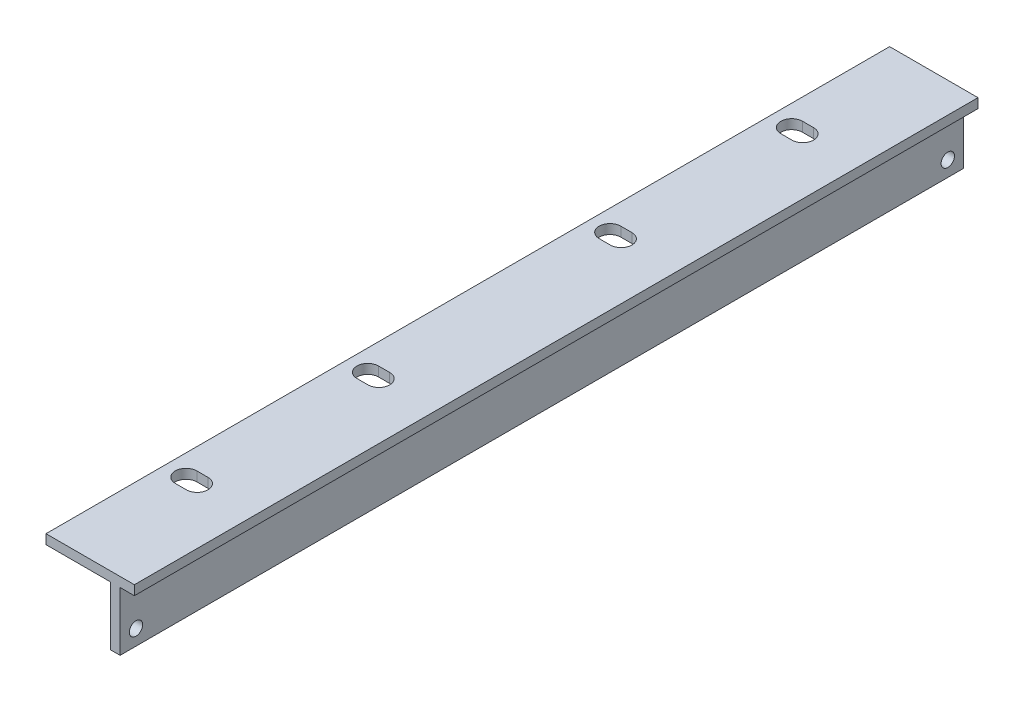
ISO-10303-21;
HEADER;
FILE_DESCRIPTION(('STEP AP214'),'2;1');
FILE_NAME('part.step','',(''),(''),'','','');
FILE_SCHEMA(('AUTOMOTIVE_DESIGN { 1 0 10303 214 1 1 1 1 }'));
ENDSEC;
DATA;
#1=APPLICATION_CONTEXT('core data for automotive mechanical design processes');
#2=APPLICATION_PROTOCOL_DEFINITION('international standard','automotive_design',2000,#1);
#3=PRODUCT_CONTEXT('',#1,'mechanical');
#4=PRODUCT('Part','Part','',(#3));
#5=PRODUCT_RELATED_PRODUCT_CATEGORY('part','',(#4));
#6=PRODUCT_DEFINITION_FORMATION('','',#4);
#7=PRODUCT_DEFINITION_CONTEXT('part definition',#1,'design');
#8=PRODUCT_DEFINITION('design','',#6,#7);
#9=PRODUCT_DEFINITION_SHAPE('','',#8);
#10=(LENGTH_UNIT() NAMED_UNIT(*) SI_UNIT(.MILLI.,.METRE.));
#11=(NAMED_UNIT(*) PLANE_ANGLE_UNIT() SI_UNIT($,.RADIAN.));
#12=(NAMED_UNIT(*) SI_UNIT($,.STERADIAN.) SOLID_ANGLE_UNIT());
#13=UNCERTAINTY_MEASURE_WITH_UNIT(LENGTH_MEASURE(1.E-05),#10,'distance_accuracy_value','');
#14=(GEOMETRIC_REPRESENTATION_CONTEXT(3) GLOBAL_UNCERTAINTY_ASSIGNED_CONTEXT((#13)) GLOBAL_UNIT_ASSIGNED_CONTEXT((#10,
#11,#12)) REPRESENTATION_CONTEXT('',''));
#15=CARTESIAN_POINT('',(0.,0.,0.));
#16=DIRECTION('',(0.,0.,1.));
#17=DIRECTION('',(1.,0.,0.));
#18=AXIS2_PLACEMENT_3D('',#15,#16,#17);
#19=CARTESIAN_POINT('',(-4.50000000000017,-2.99999999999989,-132.));
#20=DIRECTION('',(0.,-1.,0.));
#21=DIRECTION('',(0.,0.,-1.));
#22=AXIS2_PLACEMENT_3D('',#19,#20,#21);
#23=PLANE('',#22);
#24=DIRECTION('',(-1.,0.,0.));
#25=VECTOR('',#24,1.);
#26=CARTESIAN_POINT('',(-4.50000000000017,-2.99999999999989,0.));
#27=LINE('',#26,#25);
#28=CARTESIAN_POINT('',(0.,-2.99999999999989,0.));
#29=VERTEX_POINT('',#28);
#30=CARTESIAN_POINT('',(-4.50000000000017,-2.99999999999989,0.));
#31=VERTEX_POINT('',#30);
#32=EDGE_CURVE('E214',#29,#31,#27,.T.);
#33=ORIENTED_EDGE('',*,*,#32,.F.);
#34=DIRECTION('',(0.,0.,-1.));
#35=VECTOR('',#34,1.);
#36=CARTESIAN_POINT('',(0.,-2.99999999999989,-132.));
#37=LINE('',#36,#35);
#38=CARTESIAN_POINT('',(0.,-2.99999999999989,265.35));
#39=VERTEX_POINT('',#38);
#40=EDGE_CURVE('E43',#39,#29,#37,.T.);
#41=ORIENTED_EDGE('',*,*,#40,.F.);
#42=DIRECTION('',(1.,0.,0.));
#43=VECTOR('',#42,1.);
#44=CARTESIAN_POINT('',(-4.50000000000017,-2.99999999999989,265.35));
#45=LINE('',#44,#43);
#46=CARTESIAN_POINT('',(-4.50000000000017,-2.99999999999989,265.35));
#47=VERTEX_POINT('',#46);
#48=EDGE_CURVE('E243',#47,#39,#45,.T.);
#49=ORIENTED_EDGE('',*,*,#48,.F.);
#50=DIRECTION('',(0.,0.,-1.));
#51=VECTOR('',#50,1.);
#52=CARTESIAN_POINT('',(-4.50000000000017,-2.99999999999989,-132.));
#53=LINE('',#52,#51);
#54=EDGE_CURVE('E252',#31,#47,#53,.F.);
#55=ORIENTED_EDGE('',*,*,#54,.F.);
#56=EDGE_LOOP('',(#33,#41,#49,#55));
#57=FACE_BOUND('',#56,.T.);
#58=ADVANCED_FACE('F35',(#57),#23,.T.);
#59=CARTESIAN_POINT('',(-4.50000000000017,-2.99999999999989,-132.));
#60=DIRECTION('',(1.,0.,0.));
#61=DIRECTION('',(0.,0.,-1.));
#62=AXIS2_PLACEMENT_3D('',#59,#60,#61);
#63=PLANE('',#62);
#64=CARTESIAN_POINT('',(-4.50000000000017,-16.6699999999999,5.));
#65=DIRECTION('',(1.,0.,0.));
#66=DIRECTION('',(0.,0.,1.));
#67=AXIS2_PLACEMENT_3D('',#64,#65,#66);
#68=CIRCLE('',#67,2.09999999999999);
#69=CARTESIAN_POINT('',(-4.50000000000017,-16.6699999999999,7.09999999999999));
#70=VERTEX_POINT('',#69);
#71=EDGE_CURVE('E287',#70,#70,#68,.T.);
#72=ORIENTED_EDGE('',*,*,#71,.F.);
#73=EDGE_LOOP('',(#72));
#74=FACE_BOUND('',#73,.T.);
#75=CARTESIAN_POINT('',(-4.50000000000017,-16.6699999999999,260.35));
#76=DIRECTION('',(1.,0.,0.));
#77=DIRECTION('',(0.,0.,-1.));
#78=AXIS2_PLACEMENT_3D('',#75,#76,#77);
#79=CIRCLE('',#78,2.09999999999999);
#80=CARTESIAN_POINT('',(-4.50000000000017,-16.6699999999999,258.25));
#81=VERTEX_POINT('',#80);
#82=EDGE_CURVE('E276',#81,#81,#79,.T.);
#83=ORIENTED_EDGE('',*,*,#82,.F.);
#84=EDGE_LOOP('',(#83));
#85=FACE_BOUND('',#84,.T.);
#86=DIRECTION('',(0.,-1.,0.));
#87=VECTOR('',#86,1.);
#88=CARTESIAN_POINT('',(-4.50000000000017,-2.99999999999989,0.));
#89=LINE('',#88,#87);
#90=CARTESIAN_POINT('',(-4.50000000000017,-21.4999999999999,0.));
#91=VERTEX_POINT('',#90);
#92=EDGE_CURVE('E291',#31,#91,#89,.T.);
#93=ORIENTED_EDGE('',*,*,#92,.F.);
#94=ORIENTED_EDGE('',*,*,#54,.T.);
#95=DIRECTION('',(0.,1.,0.));
#96=VECTOR('',#95,1.);
#97=CARTESIAN_POINT('',(-4.50000000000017,-21.4999999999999,265.35));
#98=LINE('',#97,#96);
#99=CARTESIAN_POINT('',(-4.50000000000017,-21.4999999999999,265.35));
#100=VERTEX_POINT('',#99);
#101=EDGE_CURVE('E240',#100,#47,#98,.T.);
#102=ORIENTED_EDGE('',*,*,#101,.F.);
#103=DIRECTION('',(0.,0.,-1.));
#104=VECTOR('',#103,1.);
#105=CARTESIAN_POINT('',(-4.50000000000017,-21.4999999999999,-132.));
#106=LINE('',#105,#104);
#107=EDGE_CURVE('E270',#91,#100,#106,.F.);
#108=ORIENTED_EDGE('',*,*,#107,.F.);
#109=EDGE_LOOP('',(#93,#94,#102,#108));
#110=FACE_BOUND('',#109,.T.);
#111=ADVANCED_FACE('F455',(#74,#85,#110),#63,.T.);
#112=CARTESIAN_POINT('',(-7.50000000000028,-21.4999999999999,-132.));
#113=DIRECTION('',(0.,-1.,0.));
#114=DIRECTION('',(0.,0.,-1.));
#115=AXIS2_PLACEMENT_3D('',#112,#113,#114);
#116=PLANE('',#115);
#117=DIRECTION('',(-1.,0.,0.));
#118=VECTOR('',#117,1.);
#119=CARTESIAN_POINT('',(-7.50000000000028,-21.4999999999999,0.));
#120=LINE('',#119,#118);
#121=CARTESIAN_POINT('',(-7.50000000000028,-21.4999999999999,0.));
#122=VERTEX_POINT('',#121);
#123=EDGE_CURVE('E280',#91,#122,#120,.T.);
#124=ORIENTED_EDGE('',*,*,#123,.F.);
#125=ORIENTED_EDGE('',*,*,#107,.T.);
#126=DIRECTION('',(1.,0.,0.));
#127=VECTOR('',#126,1.);
#128=CARTESIAN_POINT('',(-7.50000000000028,-21.4999999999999,265.35));
#129=LINE('',#128,#127);
#130=CARTESIAN_POINT('',(-7.50000000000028,-21.4999999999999,265.35));
#131=VERTEX_POINT('',#130);
#132=EDGE_CURVE('E237',#131,#100,#129,.T.);
#133=ORIENTED_EDGE('',*,*,#132,.F.);
#134=DIRECTION('',(0.,0.,1.));
#135=VECTOR('',#134,1.);
#136=CARTESIAN_POINT('',(-7.50000000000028,-21.4999999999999,-132.));
#137=LINE('',#136,#135);
#138=EDGE_CURVE('E267',#122,#131,#137,.T.);
#139=ORIENTED_EDGE('',*,*,#138,.F.);
#140=EDGE_LOOP('',(#124,#125,#133,#139));
#141=FACE_BOUND('',#140,.T.);
#142=ADVANCED_FACE('F452',(#141),#116,.T.);
#143=CARTESIAN_POINT('',(-7.50000000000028,-2.99999999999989,-132.));
#144=DIRECTION('',(-1.,0.,0.));
#145=DIRECTION('',(0.,0.,1.));
#146=AXIS2_PLACEMENT_3D('',#143,#144,#145);
#147=PLANE('',#146);
#148=CARTESIAN_POINT('',(-7.50000000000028,-16.6699999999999,5.));
#149=DIRECTION('',(-1.,0.,0.));
#150=DIRECTION('',(0.,0.,1.));
#151=AXIS2_PLACEMENT_3D('',#148,#149,#150);
#152=CIRCLE('',#151,2.09999999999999);
#153=CARTESIAN_POINT('',(-7.50000000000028,-16.6699999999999,7.09999999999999));
#154=VERTEX_POINT('',#153);
#155=EDGE_CURVE('E38',#154,#154,#152,.T.);
#156=ORIENTED_EDGE('',*,*,#155,.F.);
#157=EDGE_LOOP('',(#156));
#158=FACE_BOUND('',#157,.T.);
#159=CARTESIAN_POINT('',(-7.50000000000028,-16.6699999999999,260.35));
#160=DIRECTION('',(-1.,0.,0.));
#161=DIRECTION('',(0.,0.,1.));
#162=AXIS2_PLACEMENT_3D('',#159,#160,#161);
#163=CIRCLE('',#162,2.09999999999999);
#164=CARTESIAN_POINT('',(-7.50000000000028,-16.6699999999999,262.45));
#165=VERTEX_POINT('',#164);
#166=EDGE_CURVE('E273',#165,#165,#163,.T.);
#167=ORIENTED_EDGE('',*,*,#166,.F.);
#168=EDGE_LOOP('',(#167));
#169=FACE_BOUND('',#168,.T.);
#170=DIRECTION('',(0.,1.,0.));
#171=VECTOR('',#170,1.);
#172=CARTESIAN_POINT('',(-7.50000000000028,-2.99999999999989,0.));
#173=LINE('',#172,#171);
#174=CARTESIAN_POINT('',(-7.50000000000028,-2.99999999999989,0.));
#175=VERTEX_POINT('',#174);
#176=EDGE_CURVE('E275',#122,#175,#173,.T.);
#177=ORIENTED_EDGE('',*,*,#176,.F.);
#178=ORIENTED_EDGE('',*,*,#138,.T.);
#179=DIRECTION('',(0.,-1.,0.));
#180=VECTOR('',#179,1.);
#181=CARTESIAN_POINT('',(-7.50000000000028,-2.99999999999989,265.35));
#182=LINE('',#181,#180);
#183=CARTESIAN_POINT('',(-7.50000000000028,-2.99999999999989,265.35));
#184=VERTEX_POINT('',#183);
#185=EDGE_CURVE('E234',#184,#131,#182,.T.);
#186=ORIENTED_EDGE('',*,*,#185,.F.);
#187=DIRECTION('',(0.,0.,-1.));
#188=VECTOR('',#187,1.);
#189=CARTESIAN_POINT('',(-7.50000000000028,-2.99999999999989,-132.));
#190=LINE('',#189,#188);
#191=EDGE_CURVE('E257',#175,#184,#190,.F.);
#192=ORIENTED_EDGE('',*,*,#191,.F.);
#193=EDGE_LOOP('',(#177,#178,#186,#192));
#194=FACE_BOUND('',#193,.T.);
#195=ADVANCED_FACE('F448',(#158,#169,#194),#147,.T.);
#196=CARTESIAN_POINT('',(-27.8,-2.99999999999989,-132.));
#197=DIRECTION('',(0.,-1.,0.));
#198=DIRECTION('',(0.,0.,-1.));
#199=AXIS2_PLACEMENT_3D('',#196,#197,#198);
#200=PLANE('',#199);
#201=DIRECTION('',(1.,0.,0.));
#202=VECTOR('',#201,1.);
#203=CARTESIAN_POINT('',(-24.8,-2.99999999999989,0.));
#204=LINE('',#203,#202);
#205=CARTESIAN_POINT('',(-27.8,-2.99999999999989,0.));
#206=VERTEX_POINT('',#205);
#207=EDGE_CURVE('E224',#206,#175,#204,.T.);
#208=ORIENTED_EDGE('',*,*,#207,.T.);
#209=ORIENTED_EDGE('',*,*,#191,.T.);
#210=DIRECTION('',(1.,0.,0.));
#211=VECTOR('',#210,1.);
#212=CARTESIAN_POINT('',(-27.8,-2.99999999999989,265.35));
#213=LINE('',#212,#211);
#214=CARTESIAN_POINT('',(-27.8,-2.99999999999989,265.35));
#215=VERTEX_POINT('',#214);
#216=EDGE_CURVE('E226',#215,#184,#213,.T.);
#217=ORIENTED_EDGE('',*,*,#216,.F.);
#218=DIRECTION('',(0.,0.,-1.));
#219=VECTOR('',#218,1.);
#220=CARTESIAN_POINT('',(-27.8,-2.99999999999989,265.35));
#221=LINE('',#220,#219);
#222=EDGE_CURVE('E247',#215,#206,#221,.T.);
#223=ORIENTED_EDGE('',*,*,#222,.T.);
#224=EDGE_LOOP('',(#208,#209,#217,#223));
#225=FACE_BOUND('',#224,.T.);
#226=CARTESIAN_POINT('',(-21.1799999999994,-2.99999999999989,227.925));
#227=DIRECTION('',(0.,-1.,0.));
#228=DIRECTION('',(0.,0.,-1.));
#229=AXIS2_PLACEMENT_3D('',#226,#227,#228);
#230=CIRCLE('',#229,3.39999999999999);
#231=CARTESIAN_POINT('',(-21.1799999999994,-2.99999999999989,231.325));
#232=VERTEX_POINT('',#231);
#233=CARTESIAN_POINT('',(-21.1799999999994,-2.99999999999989,224.525));
#234=VERTEX_POINT('',#233);
#235=EDGE_CURVE('E316',#232,#234,#230,.T.);
#236=ORIENTED_EDGE('',*,*,#235,.F.);
#237=DIRECTION('',(-1.,0.,0.));
#238=VECTOR('',#237,1.);
#239=CARTESIAN_POINT('',(-27.8,-2.99999999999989,231.325));
#240=LINE('',#239,#238);
#241=CARTESIAN_POINT('',(-17.6799999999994,-2.99999999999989,231.325));
#242=VERTEX_POINT('',#241);
#243=EDGE_CURVE('E306',#242,#232,#240,.T.);
#244=ORIENTED_EDGE('',*,*,#243,.F.);
#245=CARTESIAN_POINT('',(-17.6799999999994,-2.99999999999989,227.925));
#246=DIRECTION('',(0.,-1.,0.));
#247=DIRECTION('',(0.,0.,-1.));
#248=AXIS2_PLACEMENT_3D('',#245,#246,#247);
#249=CIRCLE('',#248,3.39999999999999);
#250=CARTESIAN_POINT('',(-17.6799999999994,-2.99999999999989,224.525));
#251=VERTEX_POINT('',#250);
#252=EDGE_CURVE('E312',#251,#242,#249,.T.);
#253=ORIENTED_EDGE('',*,*,#252,.F.);
#254=DIRECTION('',(1.,0.,0.));
#255=VECTOR('',#254,1.);
#256=CARTESIAN_POINT('',(-27.8,-2.99999999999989,224.525));
#257=LINE('',#256,#255);
#258=EDGE_CURVE('E314',#234,#251,#257,.T.);
#259=ORIENTED_EDGE('',*,*,#258,.F.);
#260=EDGE_LOOP('',(#236,#244,#253,#259));
#261=FACE_BOUND('',#260,.T.);
#262=CARTESIAN_POINT('',(-21.1800000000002,-2.99999999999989,37.425));
#263=DIRECTION('',(0.,-1.,0.));
#264=DIRECTION('',(0.,0.,-1.));
#265=AXIS2_PLACEMENT_3D('',#262,#263,#264);
#266=CIRCLE('',#265,3.4);
#267=CARTESIAN_POINT('',(-21.1800000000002,-2.99999999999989,40.825));
#268=VERTEX_POINT('',#267);
#269=CARTESIAN_POINT('',(-21.1800000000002,-2.99999999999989,34.025));
#270=VERTEX_POINT('',#269);
#271=EDGE_CURVE('E345',#268,#270,#266,.T.);
#272=ORIENTED_EDGE('',*,*,#271,.F.);
#273=DIRECTION('',(-1.,0.,0.));
#274=VECTOR('',#273,1.);
#275=CARTESIAN_POINT('',(-27.8,-2.99999999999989,40.825));
#276=LINE('',#275,#274);
#277=CARTESIAN_POINT('',(-17.6800000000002,-2.99999999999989,40.825));
#278=VERTEX_POINT('',#277);
#279=EDGE_CURVE('E332',#278,#268,#276,.T.);
#280=ORIENTED_EDGE('',*,*,#279,.F.);
#281=CARTESIAN_POINT('',(-17.6800000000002,-2.99999999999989,37.425));
#282=DIRECTION('',(0.,-1.,0.));
#283=DIRECTION('',(0.,0.,-1.));
#284=AXIS2_PLACEMENT_3D('',#281,#282,#283);
#285=CIRCLE('',#284,3.4);
#286=CARTESIAN_POINT('',(-17.6800000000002,-2.99999999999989,34.025));
#287=VERTEX_POINT('',#286);
#288=EDGE_CURVE('E340',#287,#278,#285,.T.);
#289=ORIENTED_EDGE('',*,*,#288,.F.);
#290=DIRECTION('',(1.,0.,0.));
#291=VECTOR('',#290,1.);
#292=CARTESIAN_POINT('',(-27.8,-2.99999999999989,34.025));
#293=LINE('',#292,#291);
#294=EDGE_CURVE('E343',#270,#287,#293,.T.);
#295=ORIENTED_EDGE('',*,*,#294,.F.);
#296=EDGE_LOOP('',(#272,#280,#289,#295));
#297=FACE_BOUND('',#296,.T.);
#298=CARTESIAN_POINT('',(-21.18,-2.99999999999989,170.775));
#299=DIRECTION('',(0.,-1.,0.));
#300=DIRECTION('',(0.,0.,-1.));
#301=AXIS2_PLACEMENT_3D('',#298,#299,#300);
#302=CIRCLE('',#301,3.39999999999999);
#303=CARTESIAN_POINT('',(-21.18,-2.99999999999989,174.175));
#304=VERTEX_POINT('',#303);
#305=CARTESIAN_POINT('',(-21.18,-2.99999999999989,167.375));
#306=VERTEX_POINT('',#305);
#307=EDGE_CURVE('E374',#304,#306,#302,.T.);
#308=ORIENTED_EDGE('',*,*,#307,.F.);
#309=DIRECTION('',(-1.,0.,0.));
#310=VECTOR('',#309,1.);
#311=CARTESIAN_POINT('',(-27.8,-2.99999999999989,174.175));
#312=LINE('',#311,#310);
#313=CARTESIAN_POINT('',(-17.68,-2.99999999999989,174.175));
#314=VERTEX_POINT('',#313);
#315=EDGE_CURVE('E361',#314,#304,#312,.T.);
#316=ORIENTED_EDGE('',*,*,#315,.F.);
#317=CARTESIAN_POINT('',(-17.68,-2.99999999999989,170.775));
#318=DIRECTION('',(0.,-1.,0.));
#319=DIRECTION('',(0.,0.,-1.));
#320=AXIS2_PLACEMENT_3D('',#317,#318,#319);
#321=CIRCLE('',#320,3.39999999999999);
#322=CARTESIAN_POINT('',(-17.68,-2.99999999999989,167.375));
#323=VERTEX_POINT('',#322);
#324=EDGE_CURVE('E369',#323,#314,#321,.T.);
#325=ORIENTED_EDGE('',*,*,#324,.F.);
#326=DIRECTION('',(1.,0.,0.));
#327=VECTOR('',#326,1.);
#328=CARTESIAN_POINT('',(-27.8,-2.99999999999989,167.375));
#329=LINE('',#328,#327);
#330=EDGE_CURVE('E372',#306,#323,#329,.T.);
#331=ORIENTED_EDGE('',*,*,#330,.F.);
#332=EDGE_LOOP('',(#308,#316,#325,#331));
#333=FACE_BOUND('',#332,.T.);
#334=CARTESIAN_POINT('',(-21.18,-2.99999999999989,94.575));
#335=DIRECTION('',(0.,-1.,0.));
#336=DIRECTION('',(0.,0.,-1.));
#337=AXIS2_PLACEMENT_3D('',#334,#335,#336);
#338=CIRCLE('',#337,3.4);
#339=CARTESIAN_POINT('',(-21.18,-2.99999999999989,97.975));
#340=VERTEX_POINT('',#339);
#341=CARTESIAN_POINT('',(-21.18,-2.99999999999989,91.175));
#342=VERTEX_POINT('',#341);
#343=EDGE_CURVE('E207',#340,#342,#338,.T.);
#344=ORIENTED_EDGE('',*,*,#343,.F.);
#345=DIRECTION('',(-1.,0.,0.));
#346=VECTOR('',#345,1.);
#347=CARTESIAN_POINT('',(-27.8,-2.99999999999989,97.975));
#348=LINE('',#347,#346);
#349=CARTESIAN_POINT('',(-17.68,-2.99999999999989,97.975));
#350=VERTEX_POINT('',#349);
#351=EDGE_CURVE('E390',#350,#340,#348,.T.);
#352=ORIENTED_EDGE('',*,*,#351,.F.);
#353=CARTESIAN_POINT('',(-17.68,-2.99999999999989,94.575));
#354=DIRECTION('',(0.,-1.,0.));
#355=DIRECTION('',(0.,0.,-1.));
#356=AXIS2_PLACEMENT_3D('',#353,#354,#355);
#357=CIRCLE('',#356,3.4);
#358=CARTESIAN_POINT('',(-17.68,-2.99999999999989,91.175));
#359=VERTEX_POINT('',#358);
#360=EDGE_CURVE('E398',#359,#350,#357,.T.);
#361=ORIENTED_EDGE('',*,*,#360,.F.);
#362=DIRECTION('',(1.,0.,0.));
#363=VECTOR('',#362,1.);
#364=CARTESIAN_POINT('',(-27.8,-2.99999999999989,91.175));
#365=LINE('',#364,#363);
#366=EDGE_CURVE('E400',#342,#359,#365,.T.);
#367=ORIENTED_EDGE('',*,*,#366,.F.);
#368=EDGE_LOOP('',(#344,#352,#361,#367));
#369=FACE_BOUND('',#368,.T.);
#370=ADVANCED_FACE('F415',(#225,#261,#297,#333,#369),#200,.T.);
#371=CARTESIAN_POINT('',(0.,0.,-132.));
#372=DIRECTION('',(1.,0.,0.));
#373=DIRECTION('',(0.,0.,-1.));
#374=AXIS2_PLACEMENT_3D('',#371,#372,#373);
#375=PLANE('',#374);
#376=DIRECTION('',(0.,-1.,0.));
#377=VECTOR('',#376,1.);
#378=CARTESIAN_POINT('',(0.,0.,0.));
#379=LINE('',#378,#377);
#380=CARTESIAN_POINT('',(0.,0.,0.));
#381=VERTEX_POINT('',#380);
#382=EDGE_CURVE('E200',#381,#29,#379,.T.);
#383=ORIENTED_EDGE('',*,*,#382,.F.);
#384=DIRECTION('',(0.,0.,1.));
#385=VECTOR('',#384,1.);
#386=CARTESIAN_POINT('',(0.,0.,-132.));
#387=LINE('',#386,#385);
#388=CARTESIAN_POINT('',(0.,0.,265.35));
#389=VERTEX_POINT('',#388);
#390=EDGE_CURVE('E11',#389,#381,#387,.F.);
#391=ORIENTED_EDGE('',*,*,#390,.F.);
#392=DIRECTION('',(0.,1.,0.));
#393=VECTOR('',#392,1.);
#394=CARTESIAN_POINT('',(0.,-2.99999999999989,265.35));
#395=LINE('',#394,#393);
#396=EDGE_CURVE('E246',#39,#389,#395,.T.);
#397=ORIENTED_EDGE('',*,*,#396,.F.);
#398=ORIENTED_EDGE('',*,*,#40,.T.);
#399=EDGE_LOOP('',(#383,#391,#397,#398));
#400=FACE_BOUND('',#399,.T.);
#401=ADVANCED_FACE('F211',(#400),#375,.T.);
#402=CARTESIAN_POINT('',(-27.8,0.,-132.));
#403=DIRECTION('',(0.,1.,0.));
#404=DIRECTION('',(0.,0.,1.));
#405=AXIS2_PLACEMENT_3D('',#402,#403,#404);
#406=PLANE('',#405);
#407=ORIENTED_EDGE('',*,*,#390,.T.);
#408=DIRECTION('',(-1.,0.,0.));
#409=VECTOR('',#408,1.);
#410=CARTESIAN_POINT('',(-24.8,0.,0.));
#411=LINE('',#410,#409);
#412=CARTESIAN_POINT('',(-27.8,0.,0.));
#413=VERTEX_POINT('',#412);
#414=EDGE_CURVE('E197',#381,#413,#411,.T.);
#415=ORIENTED_EDGE('',*,*,#414,.T.);
#416=DIRECTION('',(0.,0.,-1.));
#417=VECTOR('',#416,1.);
#418=CARTESIAN_POINT('',(-27.8,0.,265.35));
#419=LINE('',#418,#417);
#420=CARTESIAN_POINT('',(-27.8,0.,265.35));
#421=VERTEX_POINT('',#420);
#422=EDGE_CURVE('E220',#421,#413,#419,.T.);
#423=ORIENTED_EDGE('',*,*,#422,.F.);
#424=DIRECTION('',(-1.,0.,0.));
#425=VECTOR('',#424,1.);
#426=CARTESIAN_POINT('',(0.,0.,265.35));
#427=LINE('',#426,#425);
#428=EDGE_CURVE('E219',#389,#421,#427,.T.);
#429=ORIENTED_EDGE('',*,*,#428,.F.);
#430=EDGE_LOOP('',(#407,#415,#423,#429));
#431=FACE_BOUND('',#430,.T.);
#432=CARTESIAN_POINT('',(-21.1799999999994,0.,227.925));
#433=DIRECTION('',(0.,1.,0.));
#434=DIRECTION('',(0.,0.,1.));
#435=AXIS2_PLACEMENT_3D('',#432,#433,#434);
#436=CIRCLE('',#435,3.39999999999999);
#437=CARTESIAN_POINT('',(-21.1799999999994,0.,224.525));
#438=VERTEX_POINT('',#437);
#439=CARTESIAN_POINT('',(-21.1799999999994,0.,231.325));
#440=VERTEX_POINT('',#439);
#441=EDGE_CURVE('E59',#438,#440,#436,.T.);
#442=ORIENTED_EDGE('',*,*,#441,.F.);
#443=DIRECTION('',(-1.,0.,0.));
#444=VECTOR('',#443,1.);
#445=CARTESIAN_POINT('',(-21.1799999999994,0.,224.525));
#446=LINE('',#445,#444);
#447=CARTESIAN_POINT('',(-17.6799999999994,0.,224.525));
#448=VERTEX_POINT('',#447);
#449=EDGE_CURVE('E300',#448,#438,#446,.T.);
#450=ORIENTED_EDGE('',*,*,#449,.F.);
#451=CARTESIAN_POINT('',(-17.6799999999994,0.,227.925));
#452=DIRECTION('',(0.,1.,0.));
#453=DIRECTION('',(0.,0.,1.));
#454=AXIS2_PLACEMENT_3D('',#451,#452,#453);
#455=CIRCLE('',#454,3.39999999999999);
#456=CARTESIAN_POINT('',(-17.6799999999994,0.,231.325));
#457=VERTEX_POINT('',#456);
#458=EDGE_CURVE('E297',#457,#448,#455,.T.);
#459=ORIENTED_EDGE('',*,*,#458,.F.);
#460=DIRECTION('',(1.,0.,0.));
#461=VECTOR('',#460,1.);
#462=CARTESIAN_POINT('',(-21.1799999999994,0.,231.325));
#463=LINE('',#462,#461);
#464=EDGE_CURVE('E295',#440,#457,#463,.T.);
#465=ORIENTED_EDGE('',*,*,#464,.F.);
#466=EDGE_LOOP('',(#442,#450,#459,#465));
#467=FACE_BOUND('',#466,.T.);
#468=CARTESIAN_POINT('',(-21.1800000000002,0.,37.425));
#469=DIRECTION('',(0.,1.,0.));
#470=DIRECTION('',(0.,0.,1.));
#471=AXIS2_PLACEMENT_3D('',#468,#469,#470);
#472=CIRCLE('',#471,3.4);
#473=CARTESIAN_POINT('',(-21.1800000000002,0.,34.025));
#474=VERTEX_POINT('',#473);
#475=CARTESIAN_POINT('',(-21.1800000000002,0.,40.825));
#476=VERTEX_POINT('',#475);
#477=EDGE_CURVE('E318',#474,#476,#472,.T.);
#478=ORIENTED_EDGE('',*,*,#477,.F.);
#479=DIRECTION('',(-1.,0.,0.));
#480=VECTOR('',#479,1.);
#481=CARTESIAN_POINT('',(-21.1800000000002,0.,34.025));
#482=LINE('',#481,#480);
#483=CARTESIAN_POINT('',(-17.6800000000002,0.,34.025));
#484=VERTEX_POINT('',#483);
#485=EDGE_CURVE('E326',#484,#474,#482,.T.);
#486=ORIENTED_EDGE('',*,*,#485,.F.);
#487=CARTESIAN_POINT('',(-17.6800000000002,0.,37.425));
#488=DIRECTION('',(0.,1.,0.));
#489=DIRECTION('',(0.,0.,1.));
#490=AXIS2_PLACEMENT_3D('',#487,#488,#489);
#491=CIRCLE('',#490,3.4);
#492=CARTESIAN_POINT('',(-17.6800000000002,0.,40.825));
#493=VERTEX_POINT('',#492);
#494=EDGE_CURVE('E323',#493,#484,#491,.T.);
#495=ORIENTED_EDGE('',*,*,#494,.F.);
#496=DIRECTION('',(1.,0.,0.));
#497=VECTOR('',#496,1.);
#498=CARTESIAN_POINT('',(-21.1800000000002,0.,40.825));
#499=LINE('',#498,#497);
#500=EDGE_CURVE('E320',#476,#493,#499,.T.);
#501=ORIENTED_EDGE('',*,*,#500,.F.);
#502=EDGE_LOOP('',(#478,#486,#495,#501));
#503=FACE_BOUND('',#502,.T.);
#504=CARTESIAN_POINT('',(-21.18,0.,170.775));
#505=DIRECTION('',(0.,1.,0.));
#506=DIRECTION('',(0.,0.,1.));
#507=AXIS2_PLACEMENT_3D('',#504,#505,#506);
#508=CIRCLE('',#507,3.39999999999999);
#509=CARTESIAN_POINT('',(-21.18,0.,167.375));
#510=VERTEX_POINT('',#509);
#511=CARTESIAN_POINT('',(-21.18,0.,174.175));
#512=VERTEX_POINT('',#511);
#513=EDGE_CURVE('E347',#510,#512,#508,.T.);
#514=ORIENTED_EDGE('',*,*,#513,.F.);
#515=DIRECTION('',(-1.,0.,0.));
#516=VECTOR('',#515,1.);
#517=CARTESIAN_POINT('',(-21.18,0.,167.375));
#518=LINE('',#517,#516);
#519=CARTESIAN_POINT('',(-17.68,0.,167.375));
#520=VERTEX_POINT('',#519);
#521=EDGE_CURVE('E355',#520,#510,#518,.T.);
#522=ORIENTED_EDGE('',*,*,#521,.F.);
#523=CARTESIAN_POINT('',(-17.68,0.,170.775));
#524=DIRECTION('',(0.,1.,0.));
#525=DIRECTION('',(0.,0.,1.));
#526=AXIS2_PLACEMENT_3D('',#523,#524,#525);
#527=CIRCLE('',#526,3.39999999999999);
#528=CARTESIAN_POINT('',(-17.68,0.,174.175));
#529=VERTEX_POINT('',#528);
#530=EDGE_CURVE('E352',#529,#520,#527,.T.);
#531=ORIENTED_EDGE('',*,*,#530,.F.);
#532=DIRECTION('',(1.,0.,0.));
#533=VECTOR('',#532,1.);
#534=CARTESIAN_POINT('',(-21.18,0.,174.175));
#535=LINE('',#534,#533);
#536=EDGE_CURVE('E349',#512,#529,#535,.T.);
#537=ORIENTED_EDGE('',*,*,#536,.F.);
#538=EDGE_LOOP('',(#514,#522,#531,#537));
#539=FACE_BOUND('',#538,.T.);
#540=CARTESIAN_POINT('',(-21.18,0.,94.575));
#541=DIRECTION('',(0.,1.,0.));
#542=DIRECTION('',(0.,0.,1.));
#543=AXIS2_PLACEMENT_3D('',#540,#541,#542);
#544=CIRCLE('',#543,3.4);
#545=CARTESIAN_POINT('',(-21.18,0.,91.175));
#546=VERTEX_POINT('',#545);
#547=CARTESIAN_POINT('',(-21.18,0.,97.975));
#548=VERTEX_POINT('',#547);
#549=EDGE_CURVE('E376',#546,#548,#544,.T.);
#550=ORIENTED_EDGE('',*,*,#549,.F.);
#551=DIRECTION('',(-1.,0.,0.));
#552=VECTOR('',#551,1.);
#553=CARTESIAN_POINT('',(-21.18,0.,91.175));
#554=LINE('',#553,#552);
#555=CARTESIAN_POINT('',(-17.68,0.,91.175));
#556=VERTEX_POINT('',#555);
#557=EDGE_CURVE('E384',#556,#546,#554,.T.);
#558=ORIENTED_EDGE('',*,*,#557,.F.);
#559=CARTESIAN_POINT('',(-17.68,0.,94.575));
#560=DIRECTION('',(0.,1.,0.));
#561=DIRECTION('',(0.,0.,1.));
#562=AXIS2_PLACEMENT_3D('',#559,#560,#561);
#563=CIRCLE('',#562,3.4);
#564=CARTESIAN_POINT('',(-17.68,0.,97.975));
#565=VERTEX_POINT('',#564);
#566=EDGE_CURVE('E381',#565,#556,#563,.T.);
#567=ORIENTED_EDGE('',*,*,#566,.F.);
#568=DIRECTION('',(1.,0.,0.));
#569=VECTOR('',#568,1.);
#570=CARTESIAN_POINT('',(-21.18,0.,97.975));
#571=LINE('',#570,#569);
#572=EDGE_CURVE('E378',#548,#565,#571,.T.);
#573=ORIENTED_EDGE('',*,*,#572,.F.);
#574=EDGE_LOOP('',(#550,#558,#567,#573));
#575=FACE_BOUND('',#574,.T.);
#576=ADVANCED_FACE('F217',(#431,#467,#503,#539,#575),#406,.T.);
#577=CARTESIAN_POINT('',(0.,0.,0.));
#578=DIRECTION('',(0.,0.,1.));
#579=DIRECTION('',(1.,0.,0.));
#580=AXIS2_PLACEMENT_3D('',#577,#578,#579);
#581=PLANE('',#580);
#582=ORIENTED_EDGE('',*,*,#414,.F.);
#583=ORIENTED_EDGE('',*,*,#382,.T.);
#584=ORIENTED_EDGE('',*,*,#32,.T.);
#585=ORIENTED_EDGE('',*,*,#92,.T.);
#586=ORIENTED_EDGE('',*,*,#123,.T.);
#587=ORIENTED_EDGE('',*,*,#176,.T.);
#588=ORIENTED_EDGE('',*,*,#207,.F.);
#589=DIRECTION('',(0.,-1.,0.));
#590=VECTOR('',#589,1.);
#591=CARTESIAN_POINT('',(-27.8,0.,0.));
#592=LINE('',#591,#590);
#593=EDGE_CURVE('E203',#413,#206,#592,.T.);
#594=ORIENTED_EDGE('',*,*,#593,.F.);
#595=EDGE_LOOP('',(#582,#583,#584,#585,#586,#587,#588,#594));
#596=FACE_BOUND('',#595,.T.);
#597=ADVANCED_FACE('F199',(#596),#581,.F.);
#598=CARTESIAN_POINT('',(-27.8,0.,265.35));
#599=DIRECTION('',(1.,0.,0.));
#600=DIRECTION('',(0.,0.,-1.));
#601=AXIS2_PLACEMENT_3D('',#598,#599,#600);
#602=PLANE('',#601);
#603=ORIENTED_EDGE('',*,*,#593,.T.);
#604=ORIENTED_EDGE('',*,*,#222,.F.);
#605=DIRECTION('',(0.,-1.,0.));
#606=VECTOR('',#605,1.);
#607=CARTESIAN_POINT('',(-27.8,0.,265.35));
#608=LINE('',#607,#606);
#609=EDGE_CURVE('E223',#421,#215,#608,.T.);
#610=ORIENTED_EDGE('',*,*,#609,.F.);
#611=ORIENTED_EDGE('',*,*,#422,.T.);
#612=EDGE_LOOP('',(#603,#604,#610,#611));
#613=FACE_BOUND('',#612,.T.);
#614=ADVANCED_FACE('F441',(#613),#602,.F.);
#615=CARTESIAN_POINT('',(0.,0.,265.35));
#616=DIRECTION('',(0.,0.,1.));
#617=DIRECTION('',(1.,0.,0.));
#618=AXIS2_PLACEMENT_3D('',#615,#616,#617);
#619=PLANE('',#618);
#620=ORIENTED_EDGE('',*,*,#428,.T.);
#621=ORIENTED_EDGE('',*,*,#609,.T.);
#622=ORIENTED_EDGE('',*,*,#216,.T.);
#623=ORIENTED_EDGE('',*,*,#185,.T.);
#624=ORIENTED_EDGE('',*,*,#132,.T.);
#625=ORIENTED_EDGE('',*,*,#101,.T.);
#626=ORIENTED_EDGE('',*,*,#48,.T.);
#627=ORIENTED_EDGE('',*,*,#396,.T.);
#628=EDGE_LOOP('',(#620,#621,#622,#623,#624,#625,#626,#627));
#629=FACE_BOUND('',#628,.T.);
#630=ADVANCED_FACE('F473',(#629),#619,.T.);
#631=CARTESIAN_POINT('',(-21.18,-176.45,94.575));
#632=DIRECTION('',(0.,1.,0.));
#633=DIRECTION('',(0.,0.,1.));
#634=AXIS2_PLACEMENT_3D('',#631,#632,#633);
#635=CYLINDRICAL_SURFACE('',#634,3.4);
#636=ORIENTED_EDGE('',*,*,#343,.T.);
#637=DIRECTION('',(0.,1.,0.));
#638=VECTOR('',#637,1.);
#639=CARTESIAN_POINT('',(-21.18,-176.45,91.175));
#640=LINE('',#639,#638);
#641=EDGE_CURVE('E388',#342,#546,#640,.T.);
#642=ORIENTED_EDGE('',*,*,#641,.T.);
#643=ORIENTED_EDGE('',*,*,#549,.T.);
#644=DIRECTION('',(0.,1.,0.));
#645=VECTOR('',#644,1.);
#646=CARTESIAN_POINT('',(-21.18,-176.45,97.975));
#647=LINE('',#646,#645);
#648=EDGE_CURVE('E387',#340,#548,#647,.T.);
#649=ORIENTED_EDGE('',*,*,#648,.F.);
#650=EDGE_LOOP('',(#636,#642,#643,#649));
#651=FACE_BOUND('',#650,.T.);
#652=ADVANCED_FACE('F408',(#651),#635,.F.);
#653=CARTESIAN_POINT('',(-21.18,-176.45,91.175));
#654=DIRECTION('',(0.,0.,-1.));
#655=DIRECTION('',(-1.,0.,0.));
#656=AXIS2_PLACEMENT_3D('',#653,#654,#655);
#657=PLANE('',#656);
#658=ORIENTED_EDGE('',*,*,#366,.T.);
#659=DIRECTION('',(0.,1.,0.));
#660=VECTOR('',#659,1.);
#661=CARTESIAN_POINT('',(-17.68,-176.45,91.175));
#662=LINE('',#661,#660);
#663=EDGE_CURVE('E391',#359,#556,#662,.T.);
#664=ORIENTED_EDGE('',*,*,#663,.T.);
#665=ORIENTED_EDGE('',*,*,#557,.T.);
#666=ORIENTED_EDGE('',*,*,#641,.F.);
#667=EDGE_LOOP('',(#658,#664,#665,#666));
#668=FACE_BOUND('',#667,.T.);
#669=ADVANCED_FACE('F411',(#668),#657,.F.);
#670=CARTESIAN_POINT('',(-17.68,-176.45,94.575));
#671=DIRECTION('',(0.,1.,0.));
#672=DIRECTION('',(0.,0.,1.));
#673=AXIS2_PLACEMENT_3D('',#670,#671,#672);
#674=CYLINDRICAL_SURFACE('',#673,3.4);
#675=ORIENTED_EDGE('',*,*,#360,.T.);
#676=DIRECTION('',(0.,1.,0.));
#677=VECTOR('',#676,1.);
#678=CARTESIAN_POINT('',(-17.68,-176.45,97.975));
#679=LINE('',#678,#677);
#680=EDGE_CURVE('E393',#350,#565,#679,.T.);
#681=ORIENTED_EDGE('',*,*,#680,.T.);
#682=ORIENTED_EDGE('',*,*,#566,.T.);
#683=ORIENTED_EDGE('',*,*,#663,.F.);
#684=EDGE_LOOP('',(#675,#681,#682,#683));
#685=FACE_BOUND('',#684,.T.);
#686=ADVANCED_FACE('F417',(#685),#674,.F.);
#687=CARTESIAN_POINT('',(-21.18,-176.45,97.975));
#688=DIRECTION('',(0.,0.,1.));
#689=DIRECTION('',(1.,0.,0.));
#690=AXIS2_PLACEMENT_3D('',#687,#688,#689);
#691=PLANE('',#690);
#692=ORIENTED_EDGE('',*,*,#351,.T.);
#693=ORIENTED_EDGE('',*,*,#648,.T.);
#694=ORIENTED_EDGE('',*,*,#572,.T.);
#695=ORIENTED_EDGE('',*,*,#680,.F.);
#696=EDGE_LOOP('',(#692,#693,#694,#695));
#697=FACE_BOUND('',#696,.T.);
#698=ADVANCED_FACE('F422',(#697),#691,.F.);
#699=CARTESIAN_POINT('',(-21.18,-176.45,170.775));
#700=DIRECTION('',(0.,1.,0.));
#701=DIRECTION('',(0.,0.,1.));
#702=AXIS2_PLACEMENT_3D('',#699,#700,#701);
#703=CYLINDRICAL_SURFACE('',#702,3.39999999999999);
#704=ORIENTED_EDGE('',*,*,#307,.T.);
#705=DIRECTION('',(0.,1.,0.));
#706=VECTOR('',#705,1.);
#707=CARTESIAN_POINT('',(-21.18,-176.45,167.375));
#708=LINE('',#707,#706);
#709=EDGE_CURVE('E359',#306,#510,#708,.T.);
#710=ORIENTED_EDGE('',*,*,#709,.T.);
#711=ORIENTED_EDGE('',*,*,#513,.T.);
#712=DIRECTION('',(0.,1.,0.));
#713=VECTOR('',#712,1.);
#714=CARTESIAN_POINT('',(-21.18,-176.45,174.175));
#715=LINE('',#714,#713);
#716=EDGE_CURVE('E358',#304,#512,#715,.T.);
#717=ORIENTED_EDGE('',*,*,#716,.F.);
#718=EDGE_LOOP('',(#704,#710,#711,#717));
#719=FACE_BOUND('',#718,.T.);
#720=ADVANCED_FACE('F424',(#719),#703,.F.);
#721=CARTESIAN_POINT('',(-21.18,-176.45,167.375));
#722=DIRECTION('',(0.,0.,-1.));
#723=DIRECTION('',(-1.,0.,0.));
#724=AXIS2_PLACEMENT_3D('',#721,#722,#723);
#725=PLANE('',#724);
#726=ORIENTED_EDGE('',*,*,#330,.T.);
#727=DIRECTION('',(0.,1.,0.));
#728=VECTOR('',#727,1.);
#729=CARTESIAN_POINT('',(-17.68,-176.45,167.375));
#730=LINE('',#729,#728);
#731=EDGE_CURVE('E362',#323,#520,#730,.T.);
#732=ORIENTED_EDGE('',*,*,#731,.T.);
#733=ORIENTED_EDGE('',*,*,#521,.T.);
#734=ORIENTED_EDGE('',*,*,#709,.F.);
#735=EDGE_LOOP('',(#726,#732,#733,#734));
#736=FACE_BOUND('',#735,.T.);
#737=ADVANCED_FACE('F430',(#736),#725,.F.);
#738=CARTESIAN_POINT('',(-17.68,-176.45,170.775));
#739=DIRECTION('',(0.,1.,0.));
#740=DIRECTION('',(0.,0.,1.));
#741=AXIS2_PLACEMENT_3D('',#738,#739,#740);
#742=CYLINDRICAL_SURFACE('',#741,3.39999999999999);
#743=ORIENTED_EDGE('',*,*,#324,.T.);
#744=DIRECTION('',(0.,1.,0.));
#745=VECTOR('',#744,1.);
#746=CARTESIAN_POINT('',(-17.68,-176.45,174.175));
#747=LINE('',#746,#745);
#748=EDGE_CURVE('E364',#314,#529,#747,.T.);
#749=ORIENTED_EDGE('',*,*,#748,.T.);
#750=ORIENTED_EDGE('',*,*,#530,.T.);
#751=ORIENTED_EDGE('',*,*,#731,.F.);
#752=EDGE_LOOP('',(#743,#749,#750,#751));
#753=FACE_BOUND('',#752,.T.);
#754=ADVANCED_FACE('F503',(#753),#742,.F.);
#755=CARTESIAN_POINT('',(-21.18,-176.45,174.175));
#756=DIRECTION('',(0.,0.,1.));
#757=DIRECTION('',(1.,0.,0.));
#758=AXIS2_PLACEMENT_3D('',#755,#756,#757);
#759=PLANE('',#758);
#760=ORIENTED_EDGE('',*,*,#315,.T.);
#761=ORIENTED_EDGE('',*,*,#716,.T.);
#762=ORIENTED_EDGE('',*,*,#536,.T.);
#763=ORIENTED_EDGE('',*,*,#748,.F.);
#764=EDGE_LOOP('',(#760,#761,#762,#763));
#765=FACE_BOUND('',#764,.T.);
#766=ADVANCED_FACE('F499',(#765),#759,.F.);
#767=CARTESIAN_POINT('',(-21.1800000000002,-176.45,37.425));
#768=DIRECTION('',(0.,1.,0.));
#769=DIRECTION('',(0.,0.,1.));
#770=AXIS2_PLACEMENT_3D('',#767,#768,#769);
#771=CYLINDRICAL_SURFACE('',#770,3.4);
#772=ORIENTED_EDGE('',*,*,#271,.T.);
#773=DIRECTION('',(0.,1.,0.));
#774=VECTOR('',#773,1.);
#775=CARTESIAN_POINT('',(-21.1800000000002,-176.45,34.025));
#776=LINE('',#775,#774);
#777=EDGE_CURVE('E330',#270,#474,#776,.T.);
#778=ORIENTED_EDGE('',*,*,#777,.T.);
#779=ORIENTED_EDGE('',*,*,#477,.T.);
#780=DIRECTION('',(0.,1.,0.));
#781=VECTOR('',#780,1.);
#782=CARTESIAN_POINT('',(-21.1800000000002,-176.45,40.825));
#783=LINE('',#782,#781);
#784=EDGE_CURVE('E329',#268,#476,#783,.T.);
#785=ORIENTED_EDGE('',*,*,#784,.F.);
#786=EDGE_LOOP('',(#772,#778,#779,#785));
#787=FACE_BOUND('',#786,.T.);
#788=ADVANCED_FACE('F502',(#787),#771,.F.);
#789=CARTESIAN_POINT('',(-21.1800000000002,-176.45,34.025));
#790=DIRECTION('',(0.,0.,-1.));
#791=DIRECTION('',(-1.,0.,0.));
#792=AXIS2_PLACEMENT_3D('',#789,#790,#791);
#793=PLANE('',#792);
#794=ORIENTED_EDGE('',*,*,#294,.T.);
#795=DIRECTION('',(0.,1.,0.));
#796=VECTOR('',#795,1.);
#797=CARTESIAN_POINT('',(-17.6800000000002,-176.45,34.025));
#798=LINE('',#797,#796);
#799=EDGE_CURVE('E333',#287,#484,#798,.T.);
#800=ORIENTED_EDGE('',*,*,#799,.T.);
#801=ORIENTED_EDGE('',*,*,#485,.T.);
#802=ORIENTED_EDGE('',*,*,#777,.F.);
#803=EDGE_LOOP('',(#794,#800,#801,#802));
#804=FACE_BOUND('',#803,.T.);
#805=ADVANCED_FACE('F513',(#804),#793,.F.);
#806=CARTESIAN_POINT('',(-17.6800000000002,-176.45,37.425));
#807=DIRECTION('',(0.,1.,0.));
#808=DIRECTION('',(0.,0.,1.));
#809=AXIS2_PLACEMENT_3D('',#806,#807,#808);
#810=CYLINDRICAL_SURFACE('',#809,3.4);
#811=ORIENTED_EDGE('',*,*,#288,.T.);
#812=DIRECTION('',(0.,1.,0.));
#813=VECTOR('',#812,1.);
#814=CARTESIAN_POINT('',(-17.6800000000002,-176.45,40.825));
#815=LINE('',#814,#813);
#816=EDGE_CURVE('E335',#278,#493,#815,.T.);
#817=ORIENTED_EDGE('',*,*,#816,.T.);
#818=ORIENTED_EDGE('',*,*,#494,.T.);
#819=ORIENTED_EDGE('',*,*,#799,.F.);
#820=EDGE_LOOP('',(#811,#817,#818,#819));
#821=FACE_BOUND('',#820,.T.);
#822=ADVANCED_FACE('F519',(#821),#810,.F.);
#823=CARTESIAN_POINT('',(-21.1800000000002,-176.45,40.825));
#824=DIRECTION('',(0.,0.,1.));
#825=DIRECTION('',(1.,0.,0.));
#826=AXIS2_PLACEMENT_3D('',#823,#824,#825);
#827=PLANE('',#826);
#828=ORIENTED_EDGE('',*,*,#279,.T.);
#829=ORIENTED_EDGE('',*,*,#784,.T.);
#830=ORIENTED_EDGE('',*,*,#500,.T.);
#831=ORIENTED_EDGE('',*,*,#816,.F.);
#832=EDGE_LOOP('',(#828,#829,#830,#831));
#833=FACE_BOUND('',#832,.T.);
#834=ADVANCED_FACE('F515',(#833),#827,.F.);
#835=CARTESIAN_POINT('',(-21.1799999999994,-176.45,227.925));
#836=DIRECTION('',(0.,1.,0.));
#837=DIRECTION('',(0.,0.,1.));
#838=AXIS2_PLACEMENT_3D('',#835,#836,#837);
#839=CYLINDRICAL_SURFACE('',#838,3.39999999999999);
#840=ORIENTED_EDGE('',*,*,#235,.T.);
#841=DIRECTION('',(0.,1.,0.));
#842=VECTOR('',#841,1.);
#843=CARTESIAN_POINT('',(-21.1799999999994,-176.45,224.525));
#844=LINE('',#843,#842);
#845=EDGE_CURVE('E304',#234,#438,#844,.T.);
#846=ORIENTED_EDGE('',*,*,#845,.T.);
#847=ORIENTED_EDGE('',*,*,#441,.T.);
#848=DIRECTION('',(0.,1.,0.));
#849=VECTOR('',#848,1.);
#850=CARTESIAN_POINT('',(-21.1799999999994,-176.45,231.325));
#851=LINE('',#850,#849);
#852=EDGE_CURVE('E303',#232,#440,#851,.T.);
#853=ORIENTED_EDGE('',*,*,#852,.F.);
#854=EDGE_LOOP('',(#840,#846,#847,#853));
#855=FACE_BOUND('',#854,.T.);
#856=ADVANCED_FACE('F518',(#855),#839,.F.);
#857=CARTESIAN_POINT('',(-21.1799999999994,-176.45,224.525));
#858=DIRECTION('',(0.,0.,-1.));
#859=DIRECTION('',(-1.,0.,0.));
#860=AXIS2_PLACEMENT_3D('',#857,#858,#859);
#861=PLANE('',#860);
#862=ORIENTED_EDGE('',*,*,#258,.T.);
#863=DIRECTION('',(0.,1.,0.));
#864=VECTOR('',#863,1.);
#865=CARTESIAN_POINT('',(-17.6799999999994,-176.45,224.525));
#866=LINE('',#865,#864);
#867=EDGE_CURVE('E307',#251,#448,#866,.T.);
#868=ORIENTED_EDGE('',*,*,#867,.T.);
#869=ORIENTED_EDGE('',*,*,#449,.T.);
#870=ORIENTED_EDGE('',*,*,#845,.F.);
#871=EDGE_LOOP('',(#862,#868,#869,#870));
#872=FACE_BOUND('',#871,.T.);
#873=ADVANCED_FACE('F529',(#872),#861,.F.);
#874=CARTESIAN_POINT('',(-17.6799999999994,-176.45,227.925));
#875=DIRECTION('',(0.,1.,0.));
#876=DIRECTION('',(0.,0.,1.));
#877=AXIS2_PLACEMENT_3D('',#874,#875,#876);
#878=CYLINDRICAL_SURFACE('',#877,3.39999999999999);
#879=ORIENTED_EDGE('',*,*,#252,.T.);
#880=DIRECTION('',(0.,1.,0.));
#881=VECTOR('',#880,1.);
#882=CARTESIAN_POINT('',(-17.6799999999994,-176.45,231.325));
#883=LINE('',#882,#881);
#884=EDGE_CURVE('E51',#242,#457,#883,.T.);
#885=ORIENTED_EDGE('',*,*,#884,.T.);
#886=ORIENTED_EDGE('',*,*,#458,.T.);
#887=ORIENTED_EDGE('',*,*,#867,.F.);
#888=EDGE_LOOP('',(#879,#885,#886,#887));
#889=FACE_BOUND('',#888,.T.);
#890=ADVANCED_FACE('F534',(#889),#878,.F.);
#891=CARTESIAN_POINT('',(-21.1799999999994,-176.45,231.325));
#892=DIRECTION('',(0.,0.,1.));
#893=DIRECTION('',(1.,0.,0.));
#894=AXIS2_PLACEMENT_3D('',#891,#892,#893);
#895=PLANE('',#894);
#896=ORIENTED_EDGE('',*,*,#243,.T.);
#897=ORIENTED_EDGE('',*,*,#852,.T.);
#898=ORIENTED_EDGE('',*,*,#464,.T.);
#899=ORIENTED_EDGE('',*,*,#884,.F.);
#900=EDGE_LOOP('',(#896,#897,#898,#899));
#901=FACE_BOUND('',#900,.T.);
#902=ADVANCED_FACE('F530',(#901),#895,.F.);
#903=CARTESIAN_POINT('',(-27.8,-16.6699999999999,260.35));
#904=DIRECTION('',(1.,0.,0.));
#905=DIRECTION('',(0.,0.,-1.));
#906=AXIS2_PLACEMENT_3D('',#903,#904,#905);
#907=CYLINDRICAL_SURFACE('',#906,2.09999999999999);
#908=ORIENTED_EDGE('',*,*,#166,.T.);
#909=EDGE_LOOP('',(#908));
#910=FACE_BOUND('',#909,.T.);
#911=ORIENTED_EDGE('',*,*,#82,.T.);
#912=EDGE_LOOP('',(#911));
#913=FACE_BOUND('',#912,.T.);
#914=ADVANCED_FACE('F533',(#910,#913),#907,.F.);
#915=CARTESIAN_POINT('',(-27.8,-16.6699999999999,5.));
#916=DIRECTION('',(1.,0.,0.));
#917=DIRECTION('',(0.,0.,-1.));
#918=AXIS2_PLACEMENT_3D('',#915,#916,#917);
#919=CYLINDRICAL_SURFACE('',#918,2.09999999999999);
#920=ORIENTED_EDGE('',*,*,#155,.T.);
#921=EDGE_LOOP('',(#920));
#922=FACE_BOUND('',#921,.T.);
#923=ORIENTED_EDGE('',*,*,#71,.T.);
#924=EDGE_LOOP('',(#923));
#925=FACE_BOUND('',#924,.T.);
#926=ADVANCED_FACE('F543',(#922,#925),#919,.F.);
#927=CLOSED_SHELL('',(#58,#111,#142,#195,#370,#401,#576,#597,#614,#630,#652,#669,#686,#698,#720,
#737,#754,#766,#788,#805,#822,#834,#856,#873,#890,#902,#914,#926));
#928=MANIFOLD_SOLID_BREP('B2',#927);
#929=ADVANCED_BREP_SHAPE_REPRESENTATION('',(#18,#928),#14);
#930=SHAPE_DEFINITION_REPRESENTATION(#9,#929);
ENDSEC;
END-ISO-10303-21;
